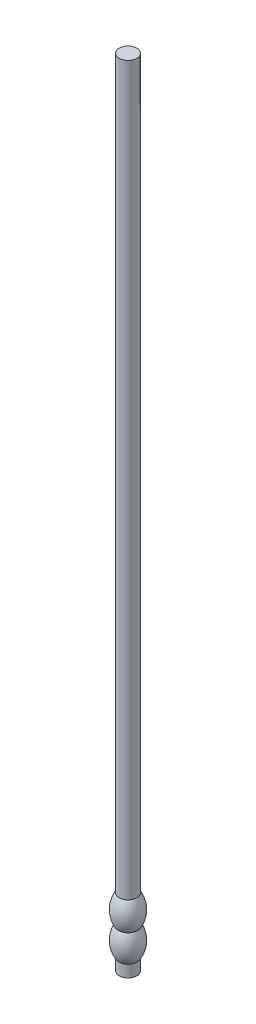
ISO-10303-21;
HEADER;
FILE_DESCRIPTION(('STEP AP214'),'2;1');
FILE_NAME('part.step','',(''),(''),'','','');
FILE_SCHEMA(('AUTOMOTIVE_DESIGN { 1 0 10303 214 1 1 1 1 }'));
ENDSEC;
DATA;
#1=APPLICATION_CONTEXT('core data for automotive mechanical design processes');
#2=APPLICATION_PROTOCOL_DEFINITION('international standard','automotive_design',2000,#1);
#3=PRODUCT_CONTEXT('',#1,'mechanical');
#4=PRODUCT('Part','Part','',(#3));
#5=PRODUCT_RELATED_PRODUCT_CATEGORY('part','',(#4));
#6=PRODUCT_DEFINITION_FORMATION('','',#4);
#7=PRODUCT_DEFINITION_CONTEXT('part definition',#1,'design');
#8=PRODUCT_DEFINITION('design','',#6,#7);
#9=PRODUCT_DEFINITION_SHAPE('','',#8);
#10=(LENGTH_UNIT() NAMED_UNIT(*) SI_UNIT(.MILLI.,.METRE.));
#11=(NAMED_UNIT(*) PLANE_ANGLE_UNIT() SI_UNIT($,.RADIAN.));
#12=(NAMED_UNIT(*) SI_UNIT($,.STERADIAN.) SOLID_ANGLE_UNIT());
#13=UNCERTAINTY_MEASURE_WITH_UNIT(LENGTH_MEASURE(1.E-05),#10,'distance_accuracy_value','');
#14=(GEOMETRIC_REPRESENTATION_CONTEXT(3) GLOBAL_UNCERTAINTY_ASSIGNED_CONTEXT((#13)) GLOBAL_UNIT_ASSIGNED_CONTEXT((#10,
#11,#12)) REPRESENTATION_CONTEXT('',''));
#15=CARTESIAN_POINT('',(0.,0.,0.));
#16=DIRECTION('',(0.,0.,1.));
#17=DIRECTION('',(1.,0.,0.));
#18=AXIS2_PLACEMENT_3D('',#15,#16,#17);
#19=CARTESIAN_POINT('',(0.,0.,0.));
#20=DIRECTION('',(0.,-1.,0.));
#21=DIRECTION('',(0.,0.,-1.));
#22=AXIS2_PLACEMENT_3D('',#19,#20,#21);
#23=PLANE('',#22);
#24=CARTESIAN_POINT('',(0.,0.,0.));
#25=DIRECTION('',(0.,-1.,0.));
#26=DIRECTION('',(0.,0.,-1.));
#27=AXIS2_PLACEMENT_3D('',#24,#25,#26);
#28=CIRCLE('',#27,10.);
#29=CARTESIAN_POINT('',(0.,0.,-10.));
#30=VERTEX_POINT('',#29);
#31=EDGE_CURVE('E10',#30,#30,#28,.T.);
#32=ORIENTED_EDGE('',*,*,#31,.T.);
#33=EDGE_LOOP('',(#32));
#34=FACE_BOUND('',#33,.T.);
#35=ADVANCED_FACE('F29',(#34),#23,.T.);
#36=CARTESIAN_POINT('',(0.,-15.8454186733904,0.));
#37=DIRECTION('',(0.,-1.,0.));
#38=DIRECTION('',(0.,0.,-1.));
#39=AXIS2_PLACEMENT_3D('',#36,#37,#38);
#40=CYLINDRICAL_SURFACE('',#39,10.);
#41=CARTESIAN_POINT('',(0.,13.416876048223,0.));
#42=DIRECTION('',(0.,-1.,0.));
#43=DIRECTION('',(0.,0.,-1.));
#44=AXIS2_PLACEMENT_3D('',#41,#42,#43);
#45=CIRCLE('',#44,10.);
#46=CARTESIAN_POINT('',(0.,13.416876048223,-10.));
#47=VERTEX_POINT('',#46);
#48=EDGE_CURVE('E35',#47,#47,#45,.T.);
#49=ORIENTED_EDGE('',*,*,#48,.T.);
#50=EDGE_LOOP('',(#49));
#51=FACE_BOUND('',#50,.T.);
#52=ORIENTED_EDGE('',*,*,#31,.F.);
#53=EDGE_LOOP('',(#52));
#54=FACE_BOUND('',#53,.T.);
#55=ADVANCED_FACE('F64',(#51,#54),#40,.T.);
#56=CARTESIAN_POINT('',(0.,30.,0.));
#57=DIRECTION('',(0.,-1.,0.));
#58=DIRECTION('',(0.,0.,-1.));
#59=AXIS2_PLACEMENT_3D('',#56,#57,#58);
#60=DEGENERATE_TOROIDAL_SURFACE('',#59,15.,30.,.F.);
#61=CARTESIAN_POINT('',(0.,45.,0.));
#62=DIRECTION('',(0.,-1.,0.));
#63=DIRECTION('',(0.,0.,-1.));
#64=AXIS2_PLACEMENT_3D('',#61,#62,#63);
#65=CIRCLE('',#64,10.9807621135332);
#66=CARTESIAN_POINT('',(0.,45.,-10.9807621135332));
#67=VERTEX_POINT('',#66);
#68=EDGE_CURVE('E39',#67,#67,#65,.T.);
#69=ORIENTED_EDGE('',*,*,#68,.T.);
#70=EDGE_LOOP('',(#69));
#71=FACE_BOUND('',#70,.T.);
#72=ORIENTED_EDGE('',*,*,#48,.F.);
#73=EDGE_LOOP('',(#72));
#74=FACE_BOUND('',#73,.T.);
#75=ADVANCED_FACE('F68',(#71,#74),#60,.F.);
#76=CARTESIAN_POINT('',(0.,60.,0.));
#77=DIRECTION('',(0.,-1.,0.));
#78=DIRECTION('',(0.,0.,-1.));
#79=AXIS2_PLACEMENT_3D('',#76,#77,#78);
#80=DEGENERATE_TOROIDAL_SURFACE('',#79,15.,30.,.F.);
#81=CARTESIAN_POINT('',(0.,76.583123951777,0.));
#82=DIRECTION('',(0.,-1.,0.));
#83=DIRECTION('',(0.,0.,-1.));
#84=AXIS2_PLACEMENT_3D('',#81,#82,#83);
#85=CIRCLE('',#84,10.);
#86=CARTESIAN_POINT('',(0.,76.583123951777,-10.));
#87=VERTEX_POINT('',#86);
#88=EDGE_CURVE('E43',#87,#87,#85,.T.);
#89=ORIENTED_EDGE('',*,*,#88,.T.);
#90=EDGE_LOOP('',(#89));
#91=FACE_BOUND('',#90,.T.);
#92=ORIENTED_EDGE('',*,*,#68,.F.);
#93=EDGE_LOOP('',(#92));
#94=FACE_BOUND('',#93,.T.);
#95=ADVANCED_FACE('F61',(#91,#94),#80,.F.);
#96=CARTESIAN_POINT('',(0.,-15.8454186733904,0.));
#97=DIRECTION('',(0.,-1.,0.));
#98=DIRECTION('',(0.,0.,-1.));
#99=AXIS2_PLACEMENT_3D('',#96,#97,#98);
#100=CYLINDRICAL_SURFACE('',#99,10.);
#101=CARTESIAN_POINT('',(0.,900.,0.));
#102=DIRECTION('',(0.,-1.,0.));
#103=DIRECTION('',(0.,0.,-1.));
#104=AXIS2_PLACEMENT_3D('',#101,#102,#103);
#105=CIRCLE('',#104,10.);
#106=CARTESIAN_POINT('',(0.,900.,-10.));
#107=VERTEX_POINT('',#106);
#108=EDGE_CURVE('E48',#107,#107,#105,.T.);
#109=ORIENTED_EDGE('',*,*,#108,.T.);
#110=EDGE_LOOP('',(#109));
#111=FACE_BOUND('',#110,.T.);
#112=ORIENTED_EDGE('',*,*,#88,.F.);
#113=EDGE_LOOP('',(#112));
#114=FACE_BOUND('',#113,.T.);
#115=ADVANCED_FACE('F52',(#111,#114),#100,.T.);
#116=CARTESIAN_POINT('',(10.,900.,0.));
#117=DIRECTION('',(0.,1.,0.));
#118=DIRECTION('',(0.,0.,1.));
#119=AXIS2_PLACEMENT_3D('',#116,#117,#118);
#120=PLANE('',#119);
#121=ORIENTED_EDGE('',*,*,#108,.F.);
#122=EDGE_LOOP('',(#121));
#123=FACE_BOUND('',#122,.T.);
#124=ADVANCED_FACE('F55',(#123),#120,.T.);
#125=CLOSED_SHELL('',(#35,#55,#75,#95,#115,#124));
#126=MANIFOLD_SOLID_BREP('B2',#125);
#127=ADVANCED_BREP_SHAPE_REPRESENTATION('',(#18,#126),#14);
#128=SHAPE_DEFINITION_REPRESENTATION(#9,#127);
ENDSEC;
END-ISO-10303-21;
